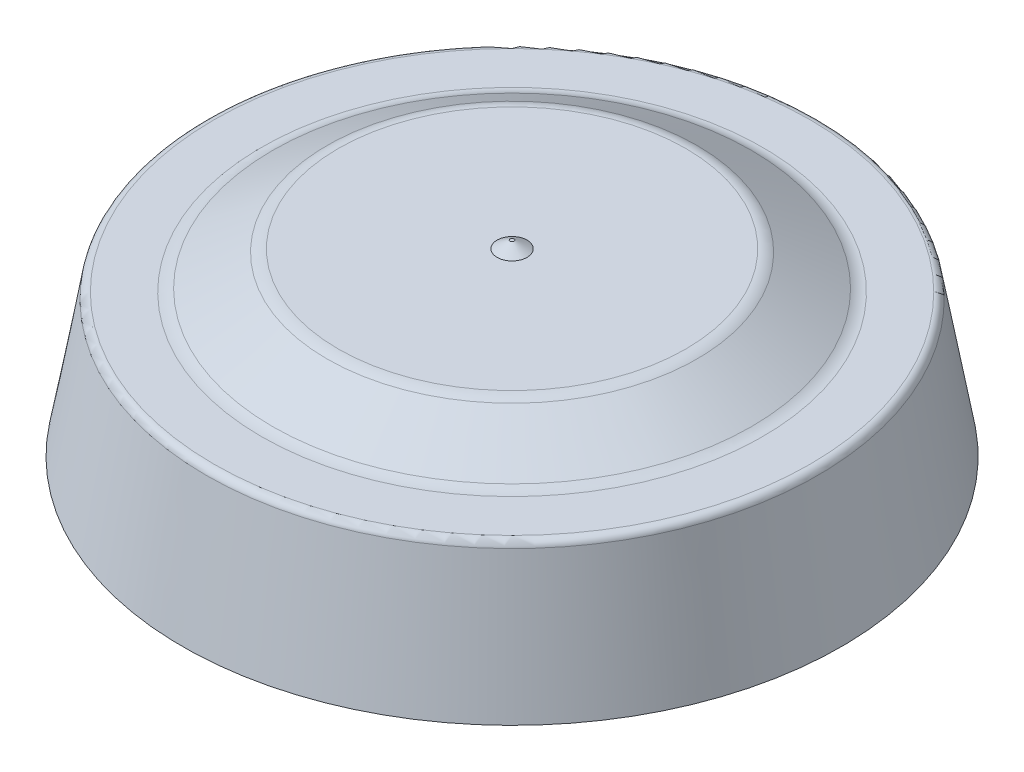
from build123d import *

# Parameters (mm, degrees)
FILLET2_R           = 1.5
SHELL2_T            = -2
FILLET3_R           = 0.5
SKETCH3_R           = 1
BOSS_EXTRUDE1_DEPTH = 0.5
BOSS_EXTRUDE1_TAPER = 60


with BuildPart() as part:
    # Sketch1 → Revolve1 (revolve)
    with BuildSketch(Plane(origin=(0, 0, 0), x_dir=(0, 0, -1), z_dir=(1, 0, 0))):
        Polygon((0, 12), (12, 12), (16.324893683, 9.5), (20.324893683, 9.5), (22, 0), (0, 0), align=None)
    revolve(axis=Axis((0, 0, 0), (0, 1, 0)))

    # Fillet2
    fillet2_edges = [part.edges().sort_by_distance(p)[0] for p in [
        (0, 9.5, 16.324893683),
        (0, 12, 12),
    ]]
    fillet(fillet2_edges, radius=FILLET2_R)

    # Shell2
    shell2_openings = [part.faces().sort_by_distance(p)[0] for p in [
        (0, 0, 0),
    ]]
    offset(amount=SHELL2_T, openings=shell2_openings, kind=Kind.INTERSECTION)

    # Fillet3
    fillet3_edges = [part.edges().sort_by_distance(p)[0] for p in [
        (0, 9.5, 20.324893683),
    ]]
    fillet(fillet3_edges, radius=FILLET3_R)

    # Sketch3 → Boss-Extrude1 (add)
    with BuildSketch(Plane(origin=(0, 12, 0), x_dir=(1, 0, 0), z_dir=(0, 1, 0))):
        Circle(SKETCH3_R)
    extrude(amount=BOSS_EXTRUDE1_DEPTH, taper=BOSS_EXTRUDE1_TAPER)


solid = part.part
